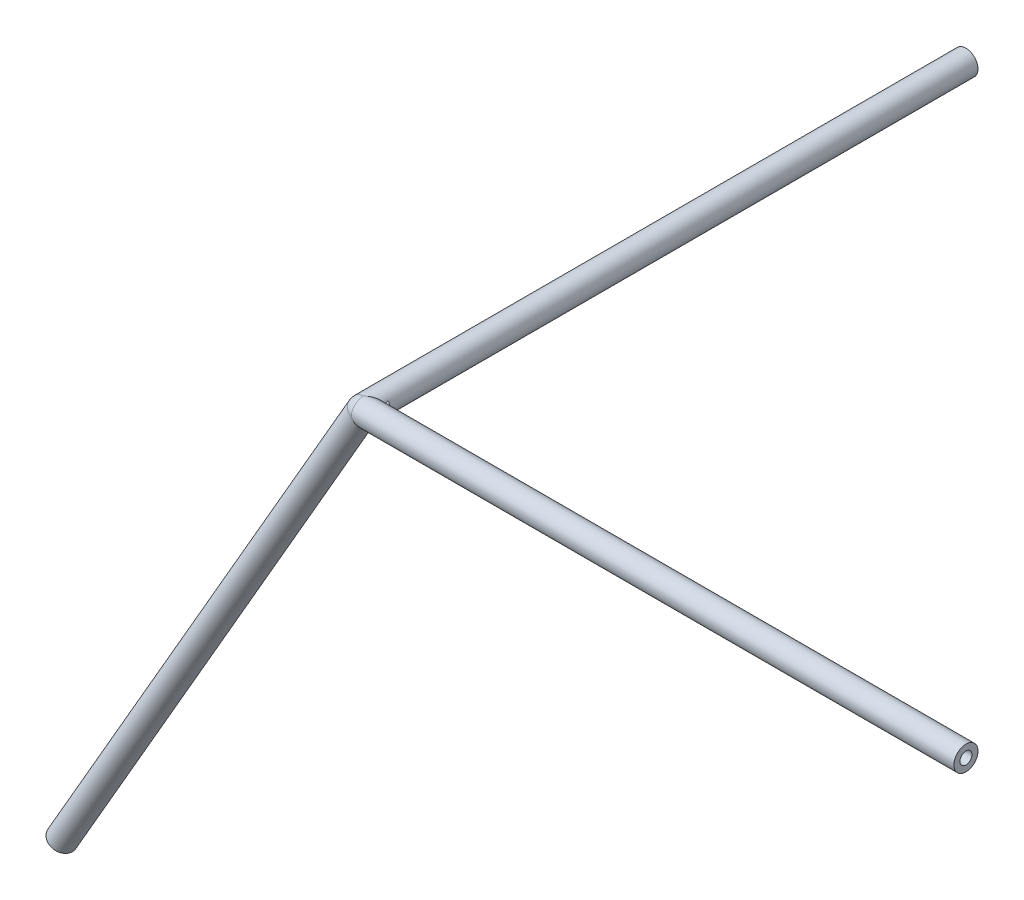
ISO-10303-21;
HEADER;
FILE_DESCRIPTION(('STEP AP214'),'2;1');
FILE_NAME('part.step','',(''),(''),'','','');
FILE_SCHEMA(('AUTOMOTIVE_DESIGN { 1 0 10303 214 1 1 1 1 }'));
ENDSEC;
DATA;
#1=APPLICATION_CONTEXT('core data for automotive mechanical design processes');
#2=APPLICATION_PROTOCOL_DEFINITION('international standard','automotive_design',2000,#1);
#3=PRODUCT_CONTEXT('',#1,'mechanical');
#4=PRODUCT('Part','Part','',(#3));
#5=PRODUCT_RELATED_PRODUCT_CATEGORY('part','',(#4));
#6=PRODUCT_DEFINITION_FORMATION('','',#4);
#7=PRODUCT_DEFINITION_CONTEXT('part definition',#1,'design');
#8=PRODUCT_DEFINITION('design','',#6,#7);
#9=PRODUCT_DEFINITION_SHAPE('','',#8);
#10=(LENGTH_UNIT() NAMED_UNIT(*) SI_UNIT(.MILLI.,.METRE.));
#11=(NAMED_UNIT(*) PLANE_ANGLE_UNIT() SI_UNIT($,.RADIAN.));
#12=(NAMED_UNIT(*) SI_UNIT($,.STERADIAN.) SOLID_ANGLE_UNIT());
#13=UNCERTAINTY_MEASURE_WITH_UNIT(LENGTH_MEASURE(1.E-05),#10,'distance_accuracy_value','');
#14=(GEOMETRIC_REPRESENTATION_CONTEXT(3) GLOBAL_UNCERTAINTY_ASSIGNED_CONTEXT((#13)) GLOBAL_UNIT_ASSIGNED_CONTEXT((#10,
#11,#12)) REPRESENTATION_CONTEXT('',''));
#15=CARTESIAN_POINT('',(0.,0.,0.));
#16=DIRECTION('',(0.,0.,1.));
#17=DIRECTION('',(1.,0.,0.));
#18=AXIS2_PLACEMENT_3D('',#15,#16,#17);
#19=CARTESIAN_POINT('',(0.,0.,0.));
#20=DIRECTION('',(1.,0.,0.));
#21=DIRECTION('',(0.,0.,-1.));
#22=AXIS2_PLACEMENT_3D('',#19,#20,#21);
#23=CYLINDRICAL_SURFACE('',#22,10.);
#24=CARTESIAN_POINT('',(12.2474487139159,-1.65082716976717,-9.86279725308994));
#25=CARTESIAN_POINT('',(12.1743298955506,-1.78822876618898,-9.83979079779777));
#26=CARTESIAN_POINT('',(12.093672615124,-1.92098861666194,-9.81462641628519));
#27=CARTESIAN_POINT('',(11.9198356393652,-2.17682382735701,-9.76107109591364));
#28=CARTESIAN_POINT('',(11.8266917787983,-2.29992535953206,-9.73268942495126));
#29=CARTESIAN_POINT('',(11.6310523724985,-2.53554719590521,-9.67396425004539));
#30=CARTESIAN_POINT('',(11.5286676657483,-2.64816670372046,-9.6436450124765));
#31=CARTESIAN_POINT('',(11.3153274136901,-2.86469305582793,-9.58155660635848));
#32=CARTESIAN_POINT('',(11.2043642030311,-2.96859193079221,-9.54978615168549));
#33=CARTESIAN_POINT('',(10.9326827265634,-3.20504967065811,-9.47355950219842));
#34=CARTESIAN_POINT('',(10.7688143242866,-3.3338873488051,-9.42878180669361));
#35=CARTESIAN_POINT('',(10.4303589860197,-3.5765937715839,-9.33941604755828));
#36=CARTESIAN_POINT('',(10.2557704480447,-3.69046027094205,-9.29482801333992));
#37=CARTESIAN_POINT('',(9.89660782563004,-3.90467747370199,-9.20689847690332));
#38=CARTESIAN_POINT('',(9.71197617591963,-4.00493544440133,-9.16356696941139));
#39=CARTESIAN_POINT('',(9.33522567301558,-4.19152815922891,-9.07973274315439));
#40=CARTESIAN_POINT('',(9.14310730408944,-4.27786380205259,-9.03922984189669));
#41=CARTESIAN_POINT('',(8.74610830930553,-4.43936254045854,-8.96104718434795));
#42=CARTESIAN_POINT('',(8.54101582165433,-4.51407048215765,-8.92350223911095));
#43=CARTESIAN_POINT('',(8.1250043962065,-4.64858449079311,-8.85417347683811));
#44=CARTESIAN_POINT('',(7.91408466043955,-4.70838850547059,-8.82239045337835));
#45=CARTESIAN_POINT('',(7.48815393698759,-4.81222273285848,-8.76618429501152));
#46=CARTESIAN_POINT('',(7.27315855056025,-4.85630379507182,-8.74173747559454));
#47=CARTESIAN_POINT('',(6.83961855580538,-4.92779842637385,-8.70163787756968));
#48=CARTESIAN_POINT('',(6.62107539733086,-4.95521863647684,-8.68598159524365));
#49=CARTESIAN_POINT('',(6.24481149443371,-4.98654859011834,-8.6680183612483));
#50=CARTESIAN_POINT('',(6.08757768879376,-4.99494021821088,-8.66317369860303));
#51=CARTESIAN_POINT('',(5.77283583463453,-5.00168659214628,-8.65928145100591));
#52=CARTESIAN_POINT('',(5.615327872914,-5.00004408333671,-8.66023228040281));
#53=CARTESIAN_POINT('',(5.30098545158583,-4.9859420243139,-8.66835916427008));
#54=CARTESIAN_POINT('',(5.14415079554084,-4.97348587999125,-8.67553325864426));
#55=CARTESIAN_POINT('',(4.83224702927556,-4.93696044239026,-8.69637088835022));
#56=CARTESIAN_POINT('',(4.67717793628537,-4.91289103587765,-8.71003448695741));
#57=CARTESIAN_POINT('',(4.3685629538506,-4.85209223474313,-8.74405104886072));
#58=CARTESIAN_POINT('',(4.21504975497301,-4.81523358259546,-8.76447220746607));
#59=CARTESIAN_POINT('',(3.91278019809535,-4.72833180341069,-8.81165818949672));
#60=CARTESIAN_POINT('',(3.76402384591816,-4.67828866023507,-8.83842302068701));
#61=CARTESIAN_POINT('',(3.47300572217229,-4.56474881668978,-8.8975928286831));
#62=CARTESIAN_POINT('',(3.33073977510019,-4.50126091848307,-8.9299941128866));
#63=CARTESIAN_POINT('',(3.05419473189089,-4.36084355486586,-8.99939807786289));
#64=CARTESIAN_POINT('',(2.91991447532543,-4.28391604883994,-9.03640008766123));
#65=CARTESIAN_POINT('',(2.67977184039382,-4.12926524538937,-9.10798099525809));
#66=CARTESIAN_POINT('',(2.57263057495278,-4.05331463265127,-9.14211890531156));
#67=CARTESIAN_POINT('',(2.36590118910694,-3.89232787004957,-9.21181160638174));
#68=CARTESIAN_POINT('',(2.26631279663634,-3.80729204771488,-9.24736634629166));
#69=CARTESIAN_POINT('',(2.07527042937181,-3.62868272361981,-9.31890089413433));
#70=CARTESIAN_POINT('',(1.98381707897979,-3.53510856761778,-9.35488073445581));
#71=CARTESIAN_POINT('',(1.80949324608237,-3.34008103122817,-9.42627386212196));
#72=CARTESIAN_POINT('',(1.72662293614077,-3.2386274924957,-9.46168713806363));
#73=CARTESIAN_POINT('',(1.57198424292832,-3.03151074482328,-9.5300314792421));
#74=CARTESIAN_POINT('',(1.4999704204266,-2.92604426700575,-9.56300424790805));
#75=CARTESIAN_POINT('',(1.36454847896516,-2.70903878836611,-9.62672839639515));
#76=CARTESIAN_POINT('',(1.30114318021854,-2.59749781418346,-9.65747904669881));
#77=CARTESIAN_POINT('',(1.18313303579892,-2.36916150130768,-9.71601561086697));
#78=CARTESIAN_POINT('',(1.12852523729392,-2.25236794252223,-9.74380251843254));
#79=CARTESIAN_POINT('',(1.02816589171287,-2.01421744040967,-9.79580467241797));
#80=CARTESIAN_POINT('',(0.98241767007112,-1.89285880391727,-9.82001857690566));
#81=CARTESIAN_POINT('',(0.898167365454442,-1.64131763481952,-9.86524553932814));
#82=CARTESIAN_POINT('',(0.860042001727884,-1.51097761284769,-9.88608537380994));
#83=CARTESIAN_POINT('',(0.793535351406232,-1.24710303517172,-9.92282653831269));
#84=CARTESIAN_POINT('',(0.765157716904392,-1.11356730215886,-9.93872601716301));
#85=CARTESIAN_POINT('',(0.718201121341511,-0.844273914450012,-9.96521474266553));
#86=CARTESIAN_POINT('',(0.699621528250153,-0.708516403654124,-9.97580433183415));
#87=CARTESIAN_POINT('',(0.672278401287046,-0.435696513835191,-9.99143826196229));
#88=CARTESIAN_POINT('',(0.663515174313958,-0.298634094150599,-9.99648242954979));
#89=CARTESIAN_POINT('',(0.655741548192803,-0.0215193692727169,-10.0009551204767));
#90=CARTESIAN_POINT('',(0.656920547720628,0.11854005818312,-10.000274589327));
#91=CARTESIAN_POINT('',(0.669482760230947,0.398050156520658,-9.99305266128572));
#92=CARTESIAN_POINT('',(0.68086611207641,0.53750081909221,-9.98651118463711));
#93=CARTESIAN_POINT('',(0.713825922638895,0.814815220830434,-9.967717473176));
#94=CARTESIAN_POINT('',(0.735403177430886,0.952678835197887,-9.95546479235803));
#95=CARTESIAN_POINT('',(0.788725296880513,1.22582356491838,-9.9255343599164));
#96=CARTESIAN_POINT('',(0.820469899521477,1.36110474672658,-9.90785674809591));
#97=CARTESIAN_POINT('',(0.894149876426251,1.62835067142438,-9.86746009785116));
#98=CARTESIAN_POINT('',(0.936102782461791,1.76030927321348,-9.84473239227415));
#99=CARTESIAN_POINT('',(1.03008993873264,2.01965778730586,-9.79481569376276));
#100=CARTESIAN_POINT('',(1.08212029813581,2.14704944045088,-9.76762842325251));
#101=CARTESIAN_POINT('',(1.19620110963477,2.39642850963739,-9.70945575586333));
#102=CARTESIAN_POINT('',(1.25825553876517,2.51841375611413,-9.67846885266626));
#103=CARTESIAN_POINT('',(1.39220085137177,2.75596141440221,-9.61352343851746));
#104=CARTESIAN_POINT('',(1.46408764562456,2.87152646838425,-9.57956616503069));
#105=CARTESIAN_POINT('',(1.61651415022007,3.09395787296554,-9.51003830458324));
#106=CARTESIAN_POINT('',(1.69693001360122,3.20091734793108,-9.47449424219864));
#107=CARTESIAN_POINT('',(1.86683104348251,3.40692785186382,-9.40238001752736));
#108=CARTESIAN_POINT('',(1.95631246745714,3.50598211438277,-9.36581028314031));
#109=CARTESIAN_POINT('',(2.14393354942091,3.69546995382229,-9.29267540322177));
#110=CARTESIAN_POINT('',(2.24207084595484,3.78590586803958,-9.25611025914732));
#111=CARTESIAN_POINT('',(2.4464664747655,3.95754797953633,-9.1840340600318));
#112=CARTESIAN_POINT('',(2.55272446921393,4.03875456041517,-9.14852296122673));
#113=CARTESIAN_POINT('',(2.76818438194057,4.18833794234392,-9.08098498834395));
#114=CARTESIAN_POINT('',(2.87709202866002,4.25710155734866,-9.04887521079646));
#115=CARTESIAN_POINT('',(3.10100135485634,4.38539609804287,-8.98740029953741));
#116=CARTESIAN_POINT('',(3.2160050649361,4.44492392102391,-8.95803608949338));
#117=CARTESIAN_POINT('',(3.45114919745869,4.55455291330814,-8.90279862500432));
#118=CARTESIAN_POINT('',(3.57128686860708,4.60465905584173,-8.87692353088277));
#119=CARTESIAN_POINT('',(3.8158335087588,4.69553429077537,-8.82918851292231));
#120=CARTESIAN_POINT('',(3.9402440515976,4.73629989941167,-8.80733008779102));
#121=CARTESIAN_POINT('',(4.31747110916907,4.84453358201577,-8.74856590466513));
#122=CARTESIAN_POINT('',(4.57533902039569,4.89842057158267,-8.71821921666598));
#123=CARTESIAN_POINT('',(5.09723598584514,4.97266371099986,-8.67608143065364));
#124=CARTESIAN_POINT('',(5.36126969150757,4.99299365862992,-8.66430483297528));
#125=CARTESIAN_POINT('',(5.82222135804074,5.00254979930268,-8.65877736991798));
#126=CARTESIAN_POINT('',(6.019019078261,4.99840565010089,-8.66118403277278));
#127=CARTESIAN_POINT('',(6.41150191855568,4.97515460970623,-8.67456215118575));
#128=CARTESIAN_POINT('',(6.60718651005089,4.95604112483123,-8.6855373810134));
#129=CARTESIAN_POINT('',(6.99645401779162,4.90405884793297,-8.71499216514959));
#130=CARTESIAN_POINT('',(7.19003269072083,4.87116620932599,-8.73348472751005));
#131=CARTESIAN_POINT('',(7.57380601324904,4.7926018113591,-8.77684330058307));
#132=CARTESIAN_POINT('',(7.76400104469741,4.74693150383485,-8.80170858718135));
#133=CARTESIAN_POINT('',(8.14531591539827,4.64209317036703,-8.85745951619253));
#134=CARTESIAN_POINT('',(8.33632402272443,4.58259631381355,-8.88848859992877));
#135=CARTESIAN_POINT('',(8.71325692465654,4.45123074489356,-8.95499672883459));
#136=CARTESIAN_POINT('',(8.8991812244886,4.37936083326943,-8.99047620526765));
#137=CARTESIAN_POINT('',(9.26516495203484,4.22332987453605,-9.06481976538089));
#138=CARTESIAN_POINT('',(9.4452227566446,4.13916546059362,-9.1036847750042));
#139=CARTESIAN_POINT('',(9.7984243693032,3.9583865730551,-9.18373305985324));
#140=CARTESIAN_POINT('',(9.97156949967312,3.86177449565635,-9.22491588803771));
#141=CARTESIAN_POINT('',(10.2775130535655,3.67527264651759,-9.30056308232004));
#142=CARTESIAN_POINT('',(10.4117189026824,3.58760264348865,-9.33481448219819));
#143=CARTESIAN_POINT('',(10.6739259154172,3.40344691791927,-9.40352125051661));
#144=CARTESIAN_POINT('',(10.8019267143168,3.30696067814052,-9.43797663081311));
#145=CARTESIAN_POINT('',(11.0500745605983,3.10518048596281,-9.50626908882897));
#146=CARTESIAN_POINT('',(11.170252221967,2.9999250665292,-9.54010815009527));
#147=CARTESIAN_POINT('',(11.4018415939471,2.77988031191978,-9.60653254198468));
#148=CARTESIAN_POINT('',(11.5132568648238,2.66509488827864,-9.63911837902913));
#149=CARTESIAN_POINT('',(11.7397544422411,2.40953454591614,-9.70638269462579));
#150=CARTESIAN_POINT('',(11.8533466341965,2.26733469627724,-9.74076130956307));
#151=CARTESIAN_POINT('',(12.0639858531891,1.96926017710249,-9.805370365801));
#152=CARTESIAN_POINT('',(12.1609464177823,1.81332006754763,-9.83557897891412));
#153=CARTESIAN_POINT('',(12.2474487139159,1.65082716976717,-9.86279725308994));
#154=B_SPLINE_CURVE_WITH_KNOTS('',3,(#24,#25,#26,#27,#28,#29,#30,#31,#32,#33,#34,#35,#36,#37,
#38,#39,#40,#41,#42,#43,#44,#45,#46,#47,#48,#49,#50,#51,#52,#53,#54,#55,#56,#57,#58,#59,#60,#61,
#62,#63,#64,#65,#66,#67,#68,#69,#70,#71,#72,#73,#74,#75,#76,#77,#78,#79,#80,#81,#82,#83,#84,#85,
#86,#87,#88,#89,#90,#91,#92,#93,#94,#95,#96,#97,#98,#99,#100,#101,#102,#103,#104,#105,#106,#107,
#108,#109,#110,#111,#112,#113,#114,#115,#116,#117,#118,#119,#120,#121,#122,#123,#124,#125,#126,
#127,#128,#129,#130,#131,#132,#133,#134,#135,#136,#137,#138,#139,#140,#141,#142,#143,#144,#145,
#146,#147,#148,#149,#150,#151,#152,#153),.UNSPECIFIED.,.F.,.F.,(4,2,2,2,2,2,2,2,2,2,2,2,2,2,2,2,
2,2,2,2,2,2,2,2,2,2,2,2,2,2,2,2,2,2,2,2,2,2,2,2,2,2,2,2,2,2,2,2,2,2,2,2,2,2,2,2,2,2,2,2,2,2,2,2,
4),(0.,0.471408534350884,0.941492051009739,1.40654103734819,1.87201048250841,2.51068011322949,
3.14944541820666,3.79236564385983,4.43524435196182,5.09904932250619,5.7629456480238,
6.42467497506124,7.08614036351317,7.55836284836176,8.03045613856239,8.50240079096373,
8.97435004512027,9.45121521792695,9.92808097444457,10.4046354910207,10.8811205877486,
11.2876972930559,11.6942593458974,12.1008525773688,12.5074539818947,12.9026984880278,
13.2980721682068,13.6933128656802,14.0887016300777,14.5003991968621,14.9122508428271,
15.3240759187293,15.7359138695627,16.1556147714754,16.5753213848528,16.9950607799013,
17.4147893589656,17.8352439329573,18.2555364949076,18.6759962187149,19.0962816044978,
19.5111348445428,19.9258175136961,20.3403873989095,20.7549400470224,21.1526763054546,
21.5505458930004,21.9482048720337,22.3460119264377,23.1381053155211,23.9308168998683,
24.5206157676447,25.1106745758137,25.7017588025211,26.292775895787,26.8996265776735,
27.506536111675,28.113612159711,28.7205715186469,29.2120203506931,29.7034980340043,
30.1929197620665,30.6821415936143,31.2365617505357,31.7937821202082),.UNSPECIFIED.);
#155=CARTESIAN_POINT('',(12.2474487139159,-1.65082716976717,-9.86279725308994));
#156=VERTEX_POINT('',#155);
#157=CARTESIAN_POINT('',(9.01388261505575,-4.33011780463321,-9.01388261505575));
#158=VERTEX_POINT('',#157);
#159=EDGE_CURVE('E224',#156,#158,#154,.T.);
#160=ORIENTED_EDGE('',*,*,#159,.F.);
#161=CARTESIAN_POINT('',(27.0416823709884,0.,0.));
#162=DIRECTION('',(0.554699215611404,0.,-0.832050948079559));
#163=DIRECTION('',(0.832050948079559,0.,0.554699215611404));
#164=AXIS2_PLACEMENT_3D('',#161,#162,#163);
#165=ELLIPSE('',#164,18.0277882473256,10.);
#166=CARTESIAN_POINT('',(12.2474487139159,1.65082716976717,-9.86279725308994));
#167=VERTEX_POINT('',#166);
#168=EDGE_CURVE('E226',#167,#156,#165,.F.);
#169=ORIENTED_EDGE('',*,*,#168,.F.);
#170=CARTESIAN_POINT('',(9.01388261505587,4.3301178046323,-9.01388261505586));
#171=VERTEX_POINT('',#170);
#172=EDGE_CURVE('E218',#171,#167,#154,.T.);
#173=ORIENTED_EDGE('',*,*,#172,.F.);
#174=CARTESIAN_POINT('',(0.,0.,0.));
#175=DIRECTION('',(0.707106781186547,0.,0.707106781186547));
#176=DIRECTION('',(0.707106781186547,0.,-0.707106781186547));
#177=AXIS2_PLACEMENT_3D('',#174,#175,#176);
#178=ELLIPSE('',#177,14.1421356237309,10.);
#179=CARTESIAN_POINT('',(0.,10.,0.));
#180=VERTEX_POINT('',#179);
#181=EDGE_CURVE('E247',#171,#180,#178,.T.);
#182=ORIENTED_EDGE('',*,*,#181,.T.);
#183=CARTESIAN_POINT('',(0.,0.,0.));
#184=DIRECTION('',(1.,0.,0.));
#185=DIRECTION('',(0.,0.,-1.));
#186=AXIS2_PLACEMENT_3D('',#183,#184,#185);
#187=CIRCLE('',#186,10.);
#188=CARTESIAN_POINT('',(0.,0.,10.));
#189=VERTEX_POINT('',#188);
#190=EDGE_CURVE('E251',#180,#189,#187,.T.);
#191=ORIENTED_EDGE('',*,*,#190,.T.);
#192=CARTESIAN_POINT('',(0.,0.,0.));
#193=DIRECTION('',(0.86602540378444,0.499999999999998,0.));
#194=DIRECTION('',(0.499999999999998,-0.86602540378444,0.));
#195=AXIS2_PLACEMENT_3D('',#192,#193,#194);
#196=ELLIPSE('',#195,11.5470053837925,10.);
#197=CARTESIAN_POINT('',(4.99999999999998,-8.66025403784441,-4.99999999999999));
#198=VERTEX_POINT('',#197);
#199=EDGE_CURVE('E261',#198,#189,#196,.F.);
#200=ORIENTED_EDGE('',*,*,#199,.F.);
#201=EDGE_CURVE('E244',#198,#158,#178,.T.);
#202=ORIENTED_EDGE('',*,*,#201,.T.);
#203=EDGE_LOOP('',(#160,#169,#173,#182,#191,#200,#202));
#204=FACE_BOUND('',#203,.T.);
#205=CARTESIAN_POINT('',(500.,0.,0.));
#206=DIRECTION('',(1.,0.,0.));
#207=DIRECTION('',(0.,0.,-1.));
#208=AXIS2_PLACEMENT_3D('',#205,#206,#207);
#209=CIRCLE('',#208,10.);
#210=CARTESIAN_POINT('',(500.,0.,-10.));
#211=VERTEX_POINT('',#210);
#212=EDGE_CURVE('E248',#211,#211,#209,.T.);
#213=ORIENTED_EDGE('',*,*,#212,.F.);
#214=EDGE_LOOP('',(#213));
#215=FACE_BOUND('',#214,.T.);
#216=ADVANCED_FACE('F38',(#204,#215),#23,.T.);
#217=CARTESIAN_POINT('',(500.,0.,0.));
#218=DIRECTION('',(1.,0.,0.));
#219=DIRECTION('',(0.,0.,-1.));
#220=AXIS2_PLACEMENT_3D('',#217,#218,#219);
#221=PLANE('',#220);
#222=CARTESIAN_POINT('',(500.,0.,0.));
#223=DIRECTION('',(1.,0.,0.));
#224=DIRECTION('',(0.,0.,-1.));
#225=AXIS2_PLACEMENT_3D('',#222,#223,#224);
#226=CIRCLE('',#225,5.);
#227=CARTESIAN_POINT('',(500.,0.,-5.));
#228=VERTEX_POINT('',#227);
#229=EDGE_CURVE('E126',#228,#228,#226,.T.);
#230=ORIENTED_EDGE('',*,*,#229,.F.);
#231=EDGE_LOOP('',(#230));
#232=FACE_BOUND('',#231,.T.);
#233=ORIENTED_EDGE('',*,*,#212,.T.);
#234=EDGE_LOOP('',(#233));
#235=FACE_BOUND('',#234,.T.);
#236=ADVANCED_FACE('F40',(#232,#235),#221,.T.);
#237=CARTESIAN_POINT('',(0.,0.,-500.));
#238=DIRECTION('',(0.,0.,1.));
#239=DIRECTION('',(1.,0.,0.));
#240=AXIS2_PLACEMENT_3D('',#237,#238,#239);
#241=PLANE('',#240);
#242=CARTESIAN_POINT('',(0.,0.,-500.));
#243=DIRECTION('',(0.,0.,1.));
#244=DIRECTION('',(1.,0.,0.));
#245=AXIS2_PLACEMENT_3D('',#242,#243,#244);
#246=CIRCLE('',#245,5.);
#247=CARTESIAN_POINT('',(5.,0.,-500.));
#248=VERTEX_POINT('',#247);
#249=EDGE_CURVE('E135',#248,#248,#246,.T.);
#250=ORIENTED_EDGE('',*,*,#249,.T.);
#251=EDGE_LOOP('',(#250));
#252=FACE_BOUND('',#251,.T.);
#253=CARTESIAN_POINT('',(0.,0.,-500.));
#254=DIRECTION('',(0.,0.,1.));
#255=DIRECTION('',(1.,0.,0.));
#256=AXIS2_PLACEMENT_3D('',#253,#254,#255);
#257=CIRCLE('',#256,10.);
#258=CARTESIAN_POINT('',(10.,0.,-500.));
#259=VERTEX_POINT('',#258);
#260=EDGE_CURVE('E255',#259,#259,#257,.T.);
#261=ORIENTED_EDGE('',*,*,#260,.F.);
#262=EDGE_LOOP('',(#261));
#263=FACE_BOUND('',#262,.T.);
#264=ADVANCED_FACE('F196',(#252,#263),#241,.F.);
#265=CARTESIAN_POINT('',(0.,0.,0.));
#266=DIRECTION('',(0.,0.,-1.));
#267=DIRECTION('',(-1.,0.,0.));
#268=AXIS2_PLACEMENT_3D('',#265,#266,#267);
#269=CYLINDRICAL_SURFACE('',#268,10.);
#270=CARTESIAN_POINT('',(0.,0.,-18.0277422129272));
#271=DIRECTION('',(-0.277349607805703,-0.480383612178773,-0.832050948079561));
#272=DIRECTION('',(0.416025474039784,0.720577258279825,-0.5546992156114));
#273=AXIS2_PLACEMENT_3D('',#270,#271,#272);
#274=ELLIPSE('',#273,12.0184948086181,10.);
#275=CARTESIAN_POINT('',(-0.0204529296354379,-9.99997908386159,-12.2474487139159));
#276=VERTEX_POINT('',#275);
#277=CARTESIAN_POINT('',(-8.6500094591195,-5.01770229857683,-12.2474487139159));
#278=VERTEX_POINT('',#277);
#279=EDGE_CURVE('E54',#276,#278,#274,.T.);
#280=ORIENTED_EDGE('',*,*,#279,.T.);
#281=CARTESIAN_POINT('',(-8.6500094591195,-5.01770229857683,-12.2474487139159));
#282=CARTESIAN_POINT('',(-8.64621153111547,-5.0242411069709,-12.1131979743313));
#283=CARTESIAN_POINT('',(-8.64132391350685,-5.03265778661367,-11.97905755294));
#284=CARTESIAN_POINT('',(-8.62914336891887,-5.0535188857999,-11.7111575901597));
#285=CARTESIAN_POINT('',(-8.62184965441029,-5.0659646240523,-11.5773981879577));
#286=CARTESIAN_POINT('',(-8.60459134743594,-5.09522282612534,-11.3098602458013));
#287=CARTESIAN_POINT('',(-8.59461394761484,-5.11205621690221,-11.1760847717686));
#288=CARTESIAN_POINT('',(-8.57172555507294,-5.15034058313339,-10.9094687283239));
#289=CARTESIAN_POINT('',(-8.55881483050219,-5.1717911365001,-10.7766280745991));
#290=CARTESIAN_POINT('',(-8.51478507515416,-5.24421165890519,-10.3760277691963));
#291=CARTESIAN_POINT('',(-8.47860172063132,-5.30284154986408,-10.1101204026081));
#292=CARTESIAN_POINT('',(-8.38969483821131,-5.44241652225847,-9.58746967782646));
#293=CARTESIAN_POINT('',(-8.33700749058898,-5.52331274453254,-9.33070762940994));
#294=CARTESIAN_POINT('',(-8.24019876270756,-5.66592413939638,-8.94627438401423));
#295=CARTESIAN_POINT('',(-8.20331916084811,-5.71929860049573,-8.81364220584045));
#296=CARTESIAN_POINT('',(-8.12294684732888,-5.83288899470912,-8.55336036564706));
#297=CARTESIAN_POINT('',(-8.07945385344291,-5.89310521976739,-8.42571091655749));
#298=CARTESIAN_POINT('',(-7.98544095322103,-6.01987740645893,-8.17708687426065));
#299=CARTESIAN_POINT('',(-7.93495433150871,-6.08640289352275,-8.05608424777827));
#300=CARTESIAN_POINT('',(-7.82623326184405,-6.22558174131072,-7.82127662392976));
#301=CARTESIAN_POINT('',(-7.76799899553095,-6.298234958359,-7.7074714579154));
#302=CARTESIAN_POINT('',(-7.6426610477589,-6.44976715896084,-7.48707349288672));
#303=CARTESIAN_POINT('',(-7.57547000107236,-6.52870390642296,-7.38056979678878));
#304=CARTESIAN_POINT('',(-7.43239230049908,-6.69113229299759,-7.17729021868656));
#305=CARTESIAN_POINT('',(-7.35650539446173,-6.77462406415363,-7.08051461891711));
#306=CARTESIAN_POINT('',(-7.19588046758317,-6.94499931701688,-6.89770847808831));
#307=CARTESIAN_POINT('',(-7.11113616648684,-7.0318851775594,-6.81168565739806));
#308=CARTESIAN_POINT('',(-6.93297845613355,-7.20759671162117,-6.65140420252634));
#309=CARTESIAN_POINT('',(-6.8395661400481,-7.29642213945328,-6.5771440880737));
#310=CARTESIAN_POINT('',(-6.65574714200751,-7.464226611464,-6.4490075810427));
#311=CARTESIAN_POINT('',(-6.56624304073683,-7.5431558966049,-6.39376689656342));
#312=CARTESIAN_POINT('',(-6.3811615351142,-7.70035796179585,-6.29346579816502));
#313=CARTESIAN_POINT('',(-6.28558456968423,-7.77863078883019,-6.2484046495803));
#314=CARTESIAN_POINT('',(-6.08893166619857,-7.93350935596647,-6.16877608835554));
#315=CARTESIAN_POINT('',(-5.98785772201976,-8.01011568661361,-6.13420490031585));
#316=CARTESIAN_POINT('',(-5.78083757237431,-8.16077826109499,-6.07574399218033));
#317=CARTESIAN_POINT('',(-5.67489154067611,-8.23483459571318,-6.05185389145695));
#318=CARTESIAN_POINT('',(-5.46645377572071,-8.37451537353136,-6.01618064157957));
#319=CARTESIAN_POINT('',(-5.36423853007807,-8.44036731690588,-6.0036677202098));
#320=CARTESIAN_POINT('',(-5.1569103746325,-8.56861342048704,-5.98804872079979));
#321=CARTESIAN_POINT('',(-5.05179653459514,-8.63100645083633,-5.9849456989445));
#322=CARTESIAN_POINT('',(-4.83951784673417,-8.75179826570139,-5.98816878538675));
#323=CARTESIAN_POINT('',(-4.73235416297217,-8.81019923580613,-5.99448969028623));
#324=CARTESIAN_POINT('',(-4.51668563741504,-8.92268724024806,-6.01652682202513));
#325=CARTESIAN_POINT('',(-4.40818031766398,-8.97677268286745,-6.03224649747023));
#326=CARTESIAN_POINT('',(-4.19205801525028,-9.07969161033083,-6.07276016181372));
#327=CARTESIAN_POINT('',(-4.08444649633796,-9.12858145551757,-6.09744029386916));
#328=CARTESIAN_POINT('',(-3.8695999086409,-9.22170861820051,-6.15578918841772));
#329=CARTESIAN_POINT('',(-3.76236498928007,-9.26594425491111,-6.189461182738));
#330=CARTESIAN_POINT('',(-3.54923052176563,-9.34965595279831,-6.26559656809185));
#331=CARTESIAN_POINT('',(-3.44333038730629,-9.38913417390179,-6.30805594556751));
#332=CARTESIAN_POINT('',(-3.23364450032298,-9.46339898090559,-6.40155126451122));
#333=CARTESIAN_POINT('',(-3.12985954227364,-9.49818383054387,-6.45259036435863));
#334=CARTESIAN_POINT('',(-2.92423704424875,-9.56350328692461,-6.56348566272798));
#335=CARTESIAN_POINT('',(-2.82243040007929,-9.59399063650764,-6.62342693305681));
#336=CARTESIAN_POINT('',(-2.62265717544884,-9.65051562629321,-6.75134660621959));
#337=CARTESIAN_POINT('',(-2.52469199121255,-9.67655165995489,-6.81932789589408));
#338=CARTESIAN_POINT('',(-2.33340906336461,-9.72444970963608,-6.96279729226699));
#339=CARTESIAN_POINT('',(-2.24008967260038,-9.7463132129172,-7.03828270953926));
#340=CARTESIAN_POINT('',(-2.05865539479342,-9.78624398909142,-7.19624484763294));
#341=CARTESIAN_POINT('',(-1.97054242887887,-9.80430986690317,-7.27872412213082));
#342=CARTESIAN_POINT('',(-1.79545449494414,-9.83792243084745,-7.45465910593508));
#343=CARTESIAN_POINT('',(-1.70879696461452,-9.85328079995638,-7.54846684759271));
#344=CARTESIAN_POINT('',(-1.54224684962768,-9.88071813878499,-7.7423770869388));
#345=CARTESIAN_POINT('',(-1.46235693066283,-9.89279582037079,-7.84248203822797));
#346=CARTESIAN_POINT('',(-1.23328217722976,-9.92486222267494,-8.15104656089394));
#347=CARTESIAN_POINT('',(-1.09458836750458,-9.94070297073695,-8.36786132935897));
#348=CARTESIAN_POINT('',(-0.874769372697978,-9.96212381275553,-8.76452975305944));
#349=CARTESIAN_POINT('',(-0.787768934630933,-9.96923809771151,-8.94114737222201));
#350=CARTESIAN_POINT('',(-0.629472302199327,-9.98048438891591,-9.30147738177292));
#351=CARTESIAN_POINT('',(-0.558184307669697,-9.98461484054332,-9.48519341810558));
#352=CARTESIAN_POINT('',(-0.430073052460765,-9.99095392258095,-9.85826938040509));
#353=CARTESIAN_POINT('',(-0.373299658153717,-9.9931559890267,-10.04764633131));
#354=CARTESIAN_POINT('',(-0.273239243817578,-9.99639096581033,-10.4298474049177));
#355=CARTESIAN_POINT('',(-0.229949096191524,-9.99742414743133,-10.6226707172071));
#356=CARTESIAN_POINT('',(-0.147267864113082,-9.99902013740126,-11.053683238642));
#357=CARTESIAN_POINT('',(-0.11087190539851,-9.99942776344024,-11.2924474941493));
#358=CARTESIAN_POINT('',(-0.0683540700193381,-9.99977531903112,-11.6509631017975));
#359=CARTESIAN_POINT('',(-0.0562190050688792,-9.99984742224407,-11.7700509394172));
#360=CARTESIAN_POINT('',(-0.0356332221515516,-9.99994165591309,-12.0085411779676));
#361=CARTESIAN_POINT('',(-0.0271823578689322,-9.99996378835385,-12.1279435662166));
#362=CARTESIAN_POINT('',(-0.0204529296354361,-9.99997908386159,-12.2474487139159));
#363=B_SPLINE_CURVE_WITH_KNOTS('',3,(#281,#282,#283,#284,#285,#286,#287,#288,#289,#290,#291,
#292,#293,#294,#295,#296,#297,#298,#299,#300,#301,#302,#303,#304,#305,#306,#307,#308,#309,#310,
#311,#312,#313,#314,#315,#316,#317,#318,#319,#320,#321,#322,#323,#324,#325,#326,#327,#328,#329,
#330,#331,#332,#333,#334,#335,#336,#337,#338,#339,#340,#341,#342,#343,#344,#345,#346,#347,#348,
#349,#350,#351,#352,#353,#354,#355,#356,#357,#358,#359,#360,#361,#362),.UNSPECIFIED.,.F.,.F.,(4,
2,2,2,2,2,2,2,2,2,2,2,2,2,2,2,2,2,2,2,2,2,2,2,2,2,2,2,2,2,2,2,2,2,2,2,2,2,2,2,4),(0.,
0.403389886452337,0.806911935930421,1.21239497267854,1.61784095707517,2.44056932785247,
3.26150657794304,3.70412470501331,4.14676172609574,4.58736020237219,5.02794835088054,
5.47320053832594,5.91846563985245,6.36404862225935,6.80957548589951,7.20355801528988,
7.59751210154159,7.99132423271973,8.38512232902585,8.75138389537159,9.11776440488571,
9.48394269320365,9.85025542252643,10.2120677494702,10.5740102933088,10.9357878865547,
11.2976989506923,11.663322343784,12.0290774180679,12.3947018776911,12.7604604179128,
13.1459372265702,13.5315651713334,14.3023774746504,14.8926641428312,15.4832581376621,
16.0758547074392,16.6683137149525,17.3921966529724,17.7512659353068,18.1103209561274),.UNSPECIFIED.);
#364=CARTESIAN_POINT('',(-8.25693332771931,-5.64119242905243,-9.01388261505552));
#365=VERTEX_POINT('',#364);
#366=EDGE_CURVE('E162',#278,#365,#363,.T.);
#367=ORIENTED_EDGE('',*,*,#366,.T.);
#368=CARTESIAN_POINT('',(0.,0.,0.));
#369=DIRECTION('',(0.353553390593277,0.612372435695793,-0.707106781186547));
#370=DIRECTION('',(-0.353553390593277,-0.612372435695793,-0.707106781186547));
#371=AXIS2_PLACEMENT_3D('',#368,#369,#370);
#372=ELLIPSE('',#371,14.142135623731,10.);
#373=CARTESIAN_POINT('',(-8.66025403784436,5.00000000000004,0.));
#374=VERTEX_POINT('',#373);
#375=EDGE_CURVE('E243',#365,#374,#372,.T.);
#376=ORIENTED_EDGE('',*,*,#375,.T.);
#377=CARTESIAN_POINT('',(0.,0.,0.));
#378=DIRECTION('',(0.,0.,1.));
#379=DIRECTION('',(1.,0.,0.));
#380=AXIS2_PLACEMENT_3D('',#377,#378,#379);
#381=CIRCLE('',#380,10.);
#382=EDGE_CURVE('E258',#180,#374,#381,.T.);
#383=ORIENTED_EDGE('',*,*,#382,.F.);
#384=ORIENTED_EDGE('',*,*,#181,.F.);
#385=CARTESIAN_POINT('',(8.67046238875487,-4.98227678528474,-12.2474487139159));
#386=CARTESIAN_POINT('',(8.6742261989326,-4.97571827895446,-12.1131979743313));
#387=CARTESIAN_POINT('',(8.67907144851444,-4.96727713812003,-11.97905755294));
#388=CARTESIAN_POINT('',(8.6910474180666,-4.9462979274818,-11.7111575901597));
#389=CARTESIAN_POINT('',(8.69817888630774,-4.93375851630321,-11.5773981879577));
#390=CARTESIAN_POINT('',(8.71488807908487,-4.9041832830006,-11.3098602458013));
#391=CARTESIAN_POINT('',(8.72447752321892,-4.88712590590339,-11.1760847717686));
#392=CARTESIAN_POINT('',(8.74618856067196,-4.84816179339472,-10.9094687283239));
#393=CARTESIAN_POINT('',(8.75830992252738,-4.82625550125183,-10.7766280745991));
#394=CARTESIAN_POINT('',(8.79901305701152,-4.75191435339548,-10.3760277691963));
#395=CARTESIAN_POINT('',(8.83169635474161,-4.69126370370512,-10.1101204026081));
#396=CARTESIAN_POINT('',(8.90811838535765,-4.54448059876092,-9.58746967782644));
#397=CARTESIAN_POINT('',(8.95183289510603,-4.45840390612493,-9.33070762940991));
#398=CARTESIAN_POINT('',(9.02693362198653,-4.30325939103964,-8.94627438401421));
#399=CARTESIAN_POINT('',(9.05471746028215,-4.24463348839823,-8.81364220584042));
#400=CARTESIAN_POINT('',(9.11290347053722,-4.11823382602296,-8.55336036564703));
#401=CARTESIAN_POINT('',(9.14330575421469,-4.05045967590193,-8.42571091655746));
#402=CARTESIAN_POINT('',(9.20608723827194,-3.90565602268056,-8.17708687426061));
#403=CARTESIAN_POINT('',(9.23845668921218,-3.82867058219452,-8.05608424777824));
#404=CARTESIAN_POINT('',(9.30462857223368,-3.66492595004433,-7.82127662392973));
#405=CARTESIAN_POINT('',(9.3384309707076,-3.57816698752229,-7.70747145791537));
#406=CARTESIAN_POINT('',(9.40699273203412,-3.39385504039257,-7.48707349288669));
#407=CARTESIAN_POINT('',(9.44175843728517,-3.2961975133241,-7.38056979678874));
#408=CARTESIAN_POINT('',(9.51088669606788,-3.09107439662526,-7.17729021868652));
#409=CARTESIAN_POINT('',(9.54524923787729,-2.9836085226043,-7.08051461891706));
#410=CARTESIAN_POINT('',(9.61248607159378,-2.75931562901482,-6.89770847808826));
#411=CARTESIAN_POINT('',(9.64535928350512,-2.64248198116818,-6.81168565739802));
#412=CARTESIAN_POINT('',(9.7084510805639,-2.40033711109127,-6.6514042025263));
#413=CARTESIAN_POINT('',(9.73866999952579,-2.27502695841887,-6.57714408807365));
#414=CARTESIAN_POINT('',(9.79208343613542,-2.03193280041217,-6.44900758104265));
#415=CARTESIAN_POINT('',(9.81568615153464,-1.91495533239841,-6.39376689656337));
#416=CARTESIAN_POINT('',(9.85928638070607,-1.67606901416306,-6.29346579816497));
#417=CARTESIAN_POINT('',(9.87928415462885,-1.55416052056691,-6.24840464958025));
#418=CARTESIAN_POINT('',(9.91508647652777,-1.30641482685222,-6.16877608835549));
#419=CARTESIAN_POINT('',(9.9308925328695,-1.18057905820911,-6.1342049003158));
#420=CARTESIAN_POINT('',(9.95786007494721,-0.925963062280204,-6.07574399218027));
#421=CARTESIAN_POINT('',(9.96902172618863,-0.797182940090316,-6.05185389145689));
#422=CARTESIAN_POINT('',(9.98576994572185,-0.546830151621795,-6.01618064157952));
#423=CARTESIAN_POINT('',(9.99169177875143,-0.425383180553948,-6.00366772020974));
#424=CARTESIAN_POINT('',(9.9990920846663,-0.181708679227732,-5.98804872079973));
#425=CARTESIAN_POINT('',(10.0005691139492,-0.059480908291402,-5.98494569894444));
#426=CARTESIAN_POINT('',(9.99903855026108,0.184753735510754,-5.98816878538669));
#427=CARTESIAN_POINT('',(9.99603343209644,0.306760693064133,-5.99448969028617));
#428=CARTESIAN_POINT('',(9.98561663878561,0.549779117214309,-6.01652682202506));
#429=CARTESIAN_POINT('',(9.97820334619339,0.670790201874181,-6.03224649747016));
#430=CARTESIAN_POINT('',(9.95927260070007,0.90941706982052,-6.07276016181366));
#431=CARTESIAN_POINT('',(9.94780668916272,1.02705630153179,-6.0974402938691));
#432=CARTESIAN_POINT('',(9.92103388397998,1.25968248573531,-6.15578918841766));
#433=CARTESIAN_POINT('',(9.90572560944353,1.37466846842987,-6.18946118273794));
#434=CARTESIAN_POINT('',(9.87165483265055,1.60110418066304,-6.26559656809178));
#435=CARTESIAN_POINT('',(9.85289390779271,1.71255549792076,-6.30805594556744));
#436=CARTESIAN_POINT('',(9.81236617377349,1.93128120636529,-6.40155126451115));
#437=CARTESIAN_POINT('',(9.79059825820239,2.03855404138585,-6.45259036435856));
#438=CARTESIAN_POINT('',(9.74435531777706,2.24928807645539,-6.56348566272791));
#439=CARTESIAN_POINT('',(9.71985481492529,2.3526988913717,-6.62342693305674));
#440=CARTESIAN_POINT('',(9.66892027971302,2.5539700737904,-6.75134660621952));
#441=CARTESIAN_POINT('',(9.64248555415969,2.65182842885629,-6.81932789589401));
#442=CARTESIAN_POINT('',(9.58832501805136,2.84143332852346,-6.96279729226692));
#443=CARTESIAN_POINT('',(9.56059967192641,2.93318204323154,-7.03828270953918));
#444=CARTESIAN_POINT('',(9.50446359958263,3.11027412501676,-7.19624484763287));
#445=CARTESIAN_POINT('',(9.476052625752,3.19561513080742,-7.27872412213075));
#446=CARTESIAN_POINT('',(9.4176179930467,3.36405201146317,-7.45465910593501));
#447=CARTESIAN_POINT('',(9.38758996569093,3.4467788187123,-7.54846684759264));
#448=CARTESIAN_POINT('',(9.32807634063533,3.60473411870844,-7.74237708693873));
#449=CARTESIAN_POINT('',(9.29859096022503,3.67995965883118,-7.84248203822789));
#450=CARTESIAN_POINT('',(9.21182390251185,3.89437741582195,-8.15104656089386));
#451=CARTESIAN_POINT('',(9.15619548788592,4.02241015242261,-8.36786132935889));
#452=CARTESIAN_POINT('',(9.06483698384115,4.22348940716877,-8.76452975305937));
#453=CARTESIAN_POINT('',(9.02749791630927,4.3023911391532,-8.94114737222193));
#454=CARTESIAN_POINT('',(8.95808917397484,4.4451031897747,-9.30147738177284));
#455=CARTESIAN_POINT('',(8.92602225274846,4.5089056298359,-9.4851934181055));
#456=CARTESIAN_POINT('',(8.86745643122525,4.62302277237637,-9.85826938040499));
#457=CARTESIAN_POINT('',(8.84097677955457,4.67329100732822,-10.04764633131));
#458=CARTESIAN_POINT('',(8.79374814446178,4.76156335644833,-10.4298474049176));
#459=CARTESIAN_POINT('',(8.77299783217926,4.79957031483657,-10.622670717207));
#460=CARTESIAN_POINT('',(8.73303938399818,4.87197235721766,-11.0536832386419));
#461=CARTESIAN_POINT('',(8.71519441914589,4.90369599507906,-11.2924474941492));
#462=CARTESIAN_POINT('',(8.69423649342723,4.94069129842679,-11.6509631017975));
#463=CARTESIAN_POINT('',(8.68823140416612,4.95123662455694,-11.7700509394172));
#464=CARTESIAN_POINT('',(8.67802012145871,4.96911155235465,-12.0085411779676));
#465=CARTESIAN_POINT('',(8.67381385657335,4.97644128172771,-12.1279435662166));
#466=CARTESIAN_POINT('',(8.67046238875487,4.98227678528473,-12.2474487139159));
#467=B_SPLINE_CURVE_WITH_KNOTS('',3,(#385,#386,#387,#388,#389,#390,#391,#392,#393,#394,#395,
#396,#397,#398,#399,#400,#401,#402,#403,#404,#405,#406,#407,#408,#409,#410,#411,#412,#413,#414,
#415,#416,#417,#418,#419,#420,#421,#422,#423,#424,#425,#426,#427,#428,#429,#430,#431,#432,#433,
#434,#435,#436,#437,#438,#439,#440,#441,#442,#443,#444,#445,#446,#447,#448,#449,#450,#451,#452,
#453,#454,#455,#456,#457,#458,#459,#460,#461,#462,#463,#464,#465,#466),.UNSPECIFIED.,.F.,.F.,(4,
2,2,2,2,2,2,2,2,2,2,2,2,2,2,2,2,2,2,2,2,2,2,2,2,2,2,2,2,2,2,2,2,2,2,2,2,2,2,2,4),(0.,
0.403389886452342,0.806911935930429,1.21239497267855,1.61784095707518,2.44056932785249,
3.26150657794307,3.70412470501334,4.14676172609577,4.58736020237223,5.02794835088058,
5.47320053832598,5.91846563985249,6.36404862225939,6.80957548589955,7.20355801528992,
7.59751210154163,7.99132423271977,8.3851223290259,8.75138389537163,9.11776440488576,
9.4839426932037,9.85025542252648,10.2120677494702,10.5740102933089,10.9357878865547,
11.2976989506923,11.6633223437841,12.029077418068,12.3947018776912,12.7604604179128,
13.1459372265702,13.5315651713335,14.3023774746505,14.8926641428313,15.4832581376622,
16.0758547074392,16.6683137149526,17.3921966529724,17.7512659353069,18.1103209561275),.UNSPECIFIED.);
#468=CARTESIAN_POINT('',(8.67046238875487,4.98227678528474,-12.2474487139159));
#469=VERTEX_POINT('',#468);
#470=EDGE_CURVE('E234',#171,#469,#467,.T.);
#471=ORIENTED_EDGE('',*,*,#470,.T.);
#472=CARTESIAN_POINT('',(0.,0.,-18.0277422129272));
#473=DIRECTION('',(0.554699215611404,0.,-0.832050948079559));
#474=DIRECTION('',(-0.832050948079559,0.,-0.554699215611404));
#475=AXIS2_PLACEMENT_3D('',#472,#473,#474);
#476=ELLIPSE('',#475,12.0184948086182,10.);
#477=CARTESIAN_POINT('',(8.67046238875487,-4.98227678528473,-12.2474487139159));
#478=VERTEX_POINT('',#477);
#479=EDGE_CURVE('E187',#469,#478,#476,.T.);
#480=ORIENTED_EDGE('',*,*,#479,.T.);
#481=EDGE_CURVE('E186',#478,#158,#467,.T.);
#482=ORIENTED_EDGE('',*,*,#481,.T.);
#483=ORIENTED_EDGE('',*,*,#201,.F.);
#484=CARTESIAN_POINT('',(-0.756949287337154,-9.97131023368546,-9.01388261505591));
#485=VERTEX_POINT('',#484);
#486=EDGE_CURVE('E241',#198,#485,#372,.T.);
#487=ORIENTED_EDGE('',*,*,#486,.T.);
#488=EDGE_CURVE('E59',#485,#276,#363,.T.);
#489=ORIENTED_EDGE('',*,*,#488,.T.);
#490=EDGE_LOOP('',(#280,#367,#376,#383,#384,#471,#480,#482,#483,#487,#489));
#491=FACE_BOUND('',#490,.T.);
#492=ORIENTED_EDGE('',*,*,#260,.T.);
#493=EDGE_LOOP('',(#492));
#494=FACE_BOUND('',#493,.T.);
#495=ADVANCED_FACE('F164',(#491,#494),#269,.T.);
#496=CARTESIAN_POINT('',(-250.000000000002,-433.012701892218,0.));
#497=DIRECTION('',(-0.500000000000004,-0.866025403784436,0.));
#498=DIRECTION('',(0.866025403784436,-0.500000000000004,0.));
#499=AXIS2_PLACEMENT_3D('',#496,#497,#498);
#500=PLANE('',#499);
#501=CARTESIAN_POINT('',(-250.000000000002,-433.012701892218,0.));
#502=DIRECTION('',(-0.500000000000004,-0.866025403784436,0.));
#503=DIRECTION('',(0.866025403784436,-0.500000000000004,0.));
#504=AXIS2_PLACEMENT_3D('',#501,#502,#503);
#505=CIRCLE('',#504,5.00000000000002);
#506=CARTESIAN_POINT('',(-245.66987298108,-435.512701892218,0.));
#507=VERTEX_POINT('',#506);
#508=EDGE_CURVE('E142',#507,#507,#505,.T.);
#509=ORIENTED_EDGE('',*,*,#508,.F.);
#510=EDGE_LOOP('',(#509));
#511=FACE_BOUND('',#510,.T.);
#512=CARTESIAN_POINT('',(-250.000000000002,-433.012701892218,0.));
#513=DIRECTION('',(-0.500000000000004,-0.866025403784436,0.));
#514=DIRECTION('',(0.866025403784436,-0.500000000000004,0.));
#515=AXIS2_PLACEMENT_3D('',#512,#513,#514);
#516=CIRCLE('',#515,10.);
#517=CARTESIAN_POINT('',(-241.339745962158,-438.012701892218,0.));
#518=VERTEX_POINT('',#517);
#519=EDGE_CURVE('E264',#518,#518,#516,.T.);
#520=ORIENTED_EDGE('',*,*,#519,.T.);
#521=EDGE_LOOP('',(#520));
#522=FACE_BOUND('',#521,.T.);
#523=ADVANCED_FACE('F194',(#511,#522),#500,.T.);
#524=CARTESIAN_POINT('',(0.,0.,0.));
#525=DIRECTION('',(-0.500000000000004,-0.866025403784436,0.));
#526=DIRECTION('',(0.866025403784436,-0.500000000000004,0.));
#527=AXIS2_PLACEMENT_3D('',#524,#525,#526);
#528=CYLINDRICAL_SURFACE('',#527,10.);
#529=CARTESIAN_POINT('',(-7.55338262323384,-9.78118813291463,-9.86279725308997));
#530=CARTESIAN_POINT('',(-7.63581648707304,-9.64916458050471,-9.8397907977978));
#531=CARTESIAN_POINT('',(-7.71046124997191,-9.51293340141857,-9.81462641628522));
#532=CARTESIAN_POINT('',(-7.84510255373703,-9.23446855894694,-9.76107109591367));
#533=CARTESIAN_POINT('',(-7.90513967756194,-9.09225284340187,-9.73268942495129));
#534=CARTESIAN_POINT('',(-8.01137447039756,-8.80501322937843,-9.67396425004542));
#535=CARTESIAN_POINT('',(-8.05771347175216,-8.6600357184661,-9.64364501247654));
#536=CARTESIAN_POINT('',(-8.1385606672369,-8.36701446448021,-9.58155660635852));
#537=CARTESIAN_POINT('',(-8.17305812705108,-8.21896806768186,-9.54978615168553));
#538=CARTESIAN_POINT('',(-8.24199579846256,-7.86545613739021,-9.47355950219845));
#539=CARTESIAN_POINT('',(-8.27163829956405,-7.65912309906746,-9.42878180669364));
#540=CARTESIAN_POINT('',(-8.31260055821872,-7.24465896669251,-9.33941604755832));
#541=CARTESIAN_POINT('',(-8.32391757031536,-7.03652760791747,-9.29482801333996));
#542=CARTESIAN_POINT('',(-8.32985379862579,-6.61837505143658,-9.20689847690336));
#543=CARTESIAN_POINT('',(-8.32436392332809,-6.40835036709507,-9.16356696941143));
#544=CARTESIAN_POINT('',(-8.29758270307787,-5.98877850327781,-9.07973274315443));
#545=CARTESIAN_POINT('',(-8.27629237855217,-5.77923129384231,-9.03922984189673));
#546=CARTESIAN_POINT('',(-8.21765489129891,-5.35467070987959,-8.96104718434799));
#547=CARTESIAN_POINT('',(-8.17980762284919,-5.13970143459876,-8.92350223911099));
#548=CARTESIAN_POINT('',(-8.08829445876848,-4.71216796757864,-8.85417347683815));
#549=CARTESIAN_POINT('',(-8.034626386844,-4.49960411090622,-8.82239045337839));
#550=CARTESIAN_POINT('',(-7.91158410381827,-4.07882017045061,-8.76618429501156));
#551=CARTESIAN_POINT('',(-7.84226173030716,-3.8705881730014,-8.74173747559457));
#552=CARTESIAN_POINT('',(-7.6874078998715,-3.45938420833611,-8.7016378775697));
#553=CARTESIAN_POINT('',(-7.60188291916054,-3.2564101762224,-8.68598159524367));
#554=CARTESIAN_POINT('',(-7.4408835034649,-2.91489110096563,-8.66801836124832));
#555=CARTESIAN_POINT('',(-7.36953396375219,-2.77452681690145,-8.66317369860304));
#556=CARTESIAN_POINT('',(-7.21800556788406,-2.49857918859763,-8.65928145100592));
#557=CARTESIAN_POINT('',(-7.13782913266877,-2.36299454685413,-8.66023228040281));
#558=CARTESIAN_POINT('',(-6.96844518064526,-2.09781705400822,-8.66835916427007));
#559=CARTESIAN_POINT('',(-6.87924051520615,-1.96822232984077,-8.67553325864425));
#560=CARTESIAN_POINT('',(-6.69165667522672,-1.71636846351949,-8.6963708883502));
#561=CARTESIAN_POINT('',(-6.59327741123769,-1.59410939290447,-8.7100344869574));
#562=CARTESIAN_POINT('',(-6.38631661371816,-1.35724037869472,-8.74405104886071));
#563=CARTESIAN_POINT('',(-6.27763948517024,-1.24272337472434,-8.76447220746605));
#564=CARTESIAN_POINT('',(-6.05124555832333,-1.02440114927,-8.8116581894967));
#565=CARTESIAN_POINT('',(-5.93352874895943,-0.920595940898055,-8.83842302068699));
#566=CARTESIAN_POINT('',(-5.68969129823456,-0.725336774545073,-8.89759282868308));
#567=CARTESIAN_POINT('',(-5.56357619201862,-0.633874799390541,-8.92999411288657));
#568=CARTESIAN_POINT('',(-5.30369866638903,-0.464588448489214,-8.99939807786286));
#569=CARTESIAN_POINT('',(-5.16993736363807,-0.38676208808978,-9.0364000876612));
#570=CARTESIAN_POINT('',(-4.9159345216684,-0.256117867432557,-9.10798099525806));
#571=CARTESIAN_POINT('',(-4.79658872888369,-0.201306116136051,-9.14211890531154));
#572=CARTESIAN_POINT('',(-4.55380540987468,-0.102766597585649,-9.21181160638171));
#573=CARTESIAN_POINT('',(-4.43036803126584,-0.0590384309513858,-9.24736634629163));
#574=CARTESIAN_POINT('',(-4.18016663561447,0.0171044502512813,-9.3189008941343));
#575=CARTESIAN_POINT('',(-4.05340236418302,0.0495182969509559,-9.35488073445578));
#576=CARTESIAN_POINT('',(-3.79734164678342,0.102973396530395,-9.42627386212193));
#577=CARTESIAN_POINT('',(-3.66804514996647,0.124014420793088,-9.46168713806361));
#578=CARTESIAN_POINT('',(-3.41135743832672,0.15437708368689,-9.53003147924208));
#579=CARTESIAN_POINT('',(-3.28401387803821,0.16400964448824,-9.56300424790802));
#580=CARTESIAN_POINT('',(-3.02837065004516,0.172785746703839,-9.62672839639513));
#581=CARTESIAN_POINT('',(-2.90007068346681,0.171925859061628,-9.65747904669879));
#582=CARTESIAN_POINT('',(-2.6433205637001,0.159957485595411,-9.71601561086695));
#583=CARTESIAN_POINT('',(-2.51487047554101,0.148852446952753,-9.74380251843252));
#584=CARTESIAN_POINT('',(-2.25844641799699,0.116690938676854,-9.79580467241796));
#585=CARTESIAN_POINT('',(-2.13047264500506,0.0956307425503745,-9.82001857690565));
#586=CARTESIAN_POINT('',(-1.87050645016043,0.0428230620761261,-9.86524553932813));
#587=CARTESIAN_POINT('',(-1.73856599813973,0.010670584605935,-9.88608537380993));
#588=CARTESIAN_POINT('',(-1.47679058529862,-0.0636702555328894,-9.92282653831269));
#589=CARTESIAN_POINT('',(-1.34695643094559,-0.105862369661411,-9.93872601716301));
#590=CARTESIAN_POINT('',(-1.09026321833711,-0.199843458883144,-9.96521474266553));
#591=CARTESIAN_POINT('',(-0.963403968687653,-0.251631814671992,-9.97580433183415));
#592=CARTESIAN_POINT('',(-0.71346344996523,-0.364361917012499,-9.9914382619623));
#593=CARTESIAN_POINT('',(-0.590382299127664,-0.425303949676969,-9.9964824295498));
#594=CARTESIAN_POINT('',(-0.346507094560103,-0.557129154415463,-10.0009551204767));
#595=CARTESIAN_POINT('',(-0.225801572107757,-0.628179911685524,-10.000274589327));
#596=CARTESIAN_POINT('',(0.00998016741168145,-0.778814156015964,-9.99305266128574));
#597=CARTESIAN_POINT('',(0.125056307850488,-0.858397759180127,-9.98651118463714));
#598=CARTESIAN_POINT('',(0.348737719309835,-1.02559899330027,-9.96771747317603));
#599=CARTESIAN_POINT('',(0.457342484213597,-1.11321725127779,-9.95546479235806));
#600=CARTESIAN_POINT('',(0.667231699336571,-1.29596792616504,-9.92553435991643));
#601=CARTESIAN_POINT('',(0.768516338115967,-1.39110014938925,-9.90785674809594));
#602=CARTESIAN_POINT('',(0.963118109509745,-1.58853184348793,-9.8674600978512));
#603=CARTESIAN_POINT('',(1.05642115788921,-1.69084342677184,-9.84473239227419));
#604=CARTESIAN_POINT('',(1.23402998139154,-1.90191294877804,-9.7948156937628));
#605=CARTESIAN_POINT('',(1.31833920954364,-2.01066838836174,-9.76762842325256));
#606=CARTESIAN_POINT('',(1.4772674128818,-2.23415480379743,-9.70945575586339));
#607=CARTESIAN_POINT('',(1.55188252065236,-2.34888813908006,-9.67846885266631));
#608=CARTESIAN_POINT('',(1.69063217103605,-2.58366201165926,-9.61352343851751));
#609=CARTESIAN_POINT('',(1.75477104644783,-2.70370032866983,-9.57956616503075));
#610=CARTESIAN_POINT('',(1.87118904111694,-2.94692125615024,-9.5100383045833));
#611=CARTESIAN_POINT('',(1.92361073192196,-3.07004317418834,-9.4744942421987));
#612=CARTESIAN_POINT('',(2.01707054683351,-3.32018703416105,-9.40238001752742));
#613=CARTESIAN_POINT('',(2.05811334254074,-3.44720735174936,-9.36581028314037));
#614=CARTESIAN_POINT('',(2.12840408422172,-3.70443589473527,-9.29267540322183));
#615=CARTESIAN_POINT('',(2.1576552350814,-3.83464324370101,-9.25611025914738));
#616=CARTESIAN_POINT('',(2.20410384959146,-4.09747610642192,-9.18403406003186));
#617=CARTESIAN_POINT('',(2.2213018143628,-4.23010151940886,-9.14852296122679));
#618=CARTESIAN_POINT('',(2.24311486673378,-4.49148696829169,-9.08098498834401));
#619=CARTESIAN_POINT('',(2.24821208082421,-4.62018556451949,-9.04887521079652));
#620=CARTESIAN_POINT('',(2.2473637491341,-4.87824399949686,-8.98740029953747));
#621=CARTESIAN_POINT('',(2.24141450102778,-5.00760404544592,-8.95803608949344));
#622=CARTESIAN_POINT('',(2.21878392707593,-5.26605933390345,-8.90279862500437));
#623=CARTESIAN_POINT('',(2.20210828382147,-5.39515468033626,-8.87692353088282));
#624=CARTESIAN_POINT('',(2.15853522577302,-5.6523759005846,-8.82918851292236));
#625=CARTESIAN_POINT('',(2.1316340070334,-5.78050139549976,-8.80733008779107));
#626=CARTESIAN_POINT('',(2.03675359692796,-6.16130645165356,-8.74856590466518));
#627=CARTESIAN_POINT('',(1.95448714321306,-6.41157010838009,-8.71821921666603));
#628=CARTESIAN_POINT('',(1.75783510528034,-6.90066770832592,-8.67608143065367));
#629=CARTESIAN_POINT('',(1.64342450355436,-7.13949257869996,-8.66430483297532));
#630=CARTESIAN_POINT('',(1.42122453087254,-7.54346650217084,-8.65877736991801));
#631=CARTESIAN_POINT('',(1.31923673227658,-7.71182625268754,-8.6611840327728));
#632=CARTESIAN_POINT('',(1.10285932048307,-8.04010084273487,-8.67456215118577));
#633=CARTESIAN_POINT('',(0.988464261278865,-8.2000119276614,-8.68553738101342));
#634=CARTESIAN_POINT('',(0.748812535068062,-8.5111363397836,-8.71499216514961));
#635=CARTESIAN_POINT('',(0.623537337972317,-8.66233406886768,-8.73348472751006));
#636=CARTESIAN_POINT('',(0.363611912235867,-8.95540931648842,-8.77684330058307));
#637=CARTESIAN_POINT('',(0.22896274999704,-9.09728789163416,-8.80170858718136));
#638=CARTESIAN_POINT('',(-0.0524873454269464,-9.37509708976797,-8.85745951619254));
#639=CARTESIAN_POINT('',(-0.199517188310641,-9.51076653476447,-8.88848859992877));
#640=CARTESIAN_POINT('',(-0.501749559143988,-9.77151721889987,-8.95499672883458));
#641=CARTESIAN_POINT('',(-0.656952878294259,-9.8965974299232,-8.99047620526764));
#642=CARTESIAN_POINT('',(-0.97507151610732,-10.1355331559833,-9.06481976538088));
#643=CARTESIAN_POINT('',(-1.13798893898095,-10.2493855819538,-9.10368477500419));
#644=CARTESIAN_POINT('',(-1.47114885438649,-10.4648777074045,-9.18373305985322));
#645=CARTESIAN_POINT('',(-1.64138993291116,-10.566519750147,-9.22491588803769));
#646=CARTESIAN_POINT('',(-1.95587704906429,-10.7382237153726,-9.30056308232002));
#647=CARTESIAN_POINT('',(-2.09890442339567,-10.8106143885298,-9.33481448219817));
#648=CARTESIAN_POINT('',(-2.38949146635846,-10.9456144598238,-9.40352125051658));
#649=CARTESIAN_POINT('',(-2.5370514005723,-11.0082232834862,-9.43797663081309));
#650=CARTESIAN_POINT('',(-2.83587209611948,-11.1222355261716,-9.50626908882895));
#651=CARTESIAN_POINT('',(-2.98711479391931,-11.1736847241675,-9.54010815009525));
#652=CARTESIAN_POINT('',(-3.29347382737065,-11.264224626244,-9.60653254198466));
#653=CARTESIAN_POINT('',(-3.44858855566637,-11.3033203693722,-9.63911837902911));
#654=CARTESIAN_POINT('',(-3.78315909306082,-11.37169285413,-9.70638269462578));
#655=CARTESIAN_POINT('',(-3.96310387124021,-11.3989666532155,-9.74076130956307));
#656=CARTESIAN_POINT('',(-4.32656358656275,-11.432348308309,-9.80537036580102));
#657=CARTESIAN_POINT('',(-4.51009196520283,-11.4383485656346,-9.83557897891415));
#658=CARTESIAN_POINT('',(-4.69406609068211,-11.4320153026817,-9.86279725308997));
#659=B_SPLINE_CURVE_WITH_KNOTS('',3,(#529,#530,#531,#532,#533,#534,#535,#536,#537,#538,#539,
#540,#541,#542,#543,#544,#545,#546,#547,#548,#549,#550,#551,#552,#553,#554,#555,#556,#557,#558,
#559,#560,#561,#562,#563,#564,#565,#566,#567,#568,#569,#570,#571,#572,#573,#574,#575,#576,#577,
#578,#579,#580,#581,#582,#583,#584,#585,#586,#587,#588,#589,#590,#591,#592,#593,#594,#595,#596,
#597,#598,#599,#600,#601,#602,#603,#604,#605,#606,#607,#608,#609,#610,#611,#612,#613,#614,#615,
#616,#617,#618,#619,#620,#621,#622,#623,#624,#625,#626,#627,#628,#629,#630,#631,#632,#633,#634,
#635,#636,#637,#638,#639,#640,#641,#642,#643,#644,#645,#646,#647,#648,#649,#650,#651,#652,#653,
#654,#655,#656,#657,#658),.UNSPECIFIED.,.F.,.F.,(4,2,2,2,2,2,2,2,2,2,2,2,2,2,2,2,2,2,2,2,2,2,2,
2,2,2,2,2,2,2,2,2,2,2,2,2,2,2,2,2,2,2,2,2,2,2,2,2,2,2,2,2,2,2,2,2,2,2,2,2,2,2,2,2,4),(0.,
0.471408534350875,0.94149205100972,1.40654103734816,1.87201048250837,2.51068011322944,
3.14944541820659,3.79236564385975,4.43524435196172,5.09904932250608,5.76294564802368,
6.42467497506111,7.08614036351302,7.55836284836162,8.03045613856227,8.50240079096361,
8.97435004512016,9.45121521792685,9.92808097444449,10.4046354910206,10.8811205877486,
11.2876972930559,11.6942593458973,12.1008525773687,12.5074539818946,12.9026984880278,
13.2980721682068,13.6933128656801,14.0887016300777,14.500399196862,14.9122508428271,
15.3240759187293,15.7359138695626,16.1556147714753,16.5753213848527,16.9950607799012,
17.4147893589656,17.8352439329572,18.2555364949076,18.6759962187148,19.0962816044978,
19.5111348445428,19.9258175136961,20.3403873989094,20.7549400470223,21.1526763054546,
21.5505458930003,21.9482048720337,22.3460119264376,23.138105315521,23.9308168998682,
24.5206157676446,25.1106745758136,25.701758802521,26.2927758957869,26.8996265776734,
27.5065361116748,28.1136121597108,28.7205715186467,29.2120203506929,29.7034980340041,
30.1929197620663,30.6821415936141,31.2365617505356,31.7937821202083),.UNSPECIFIED.);
#660=CARTESIAN_POINT('',(-7.55338262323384,-9.78118813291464,-9.86279725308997));
#661=VERTEX_POINT('',#660);
#662=EDGE_CURVE('E11',#661,#365,#659,.T.);
#663=ORIENTED_EDGE('',*,*,#662,.F.);
#664=CARTESIAN_POINT('',(-13.5208411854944,-23.4187838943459,0.));
#665=DIRECTION('',(-0.277349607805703,-0.480383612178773,-0.832050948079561));
#666=DIRECTION('',(-0.416025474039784,-0.720577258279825,0.5546992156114));
#667=AXIS2_PLACEMENT_3D('',#664,#665,#666);
#668=ELLIPSE('',#667,18.0277882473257,10.);
#669=CARTESIAN_POINT('',(-4.69406609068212,-11.4320153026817,-9.86279725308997));
#670=VERTEX_POINT('',#669);
#671=EDGE_CURVE('E42',#670,#661,#668,.F.);
#672=ORIENTED_EDGE('',*,*,#671,.F.);
#673=EDGE_CURVE('E47',#485,#670,#659,.T.);
#674=ORIENTED_EDGE('',*,*,#673,.F.);
#675=ORIENTED_EDGE('',*,*,#486,.F.);
#676=ORIENTED_EDGE('',*,*,#199,.T.);
#677=CARTESIAN_POINT('',(0.,0.,0.));
#678=DIRECTION('',(-0.500000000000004,-0.866025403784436,0.));
#679=DIRECTION('',(0.866025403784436,-0.500000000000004,0.));
#680=AXIS2_PLACEMENT_3D('',#677,#678,#679);
#681=CIRCLE('',#680,10.);
#682=EDGE_CURVE('E266',#189,#374,#681,.T.);
#683=ORIENTED_EDGE('',*,*,#682,.T.);
#684=ORIENTED_EDGE('',*,*,#375,.F.);
#685=EDGE_LOOP('',(#663,#672,#674,#675,#676,#683,#684));
#686=FACE_BOUND('',#685,.T.);
#687=ORIENTED_EDGE('',*,*,#519,.F.);
#688=EDGE_LOOP('',(#687));
#689=FACE_BOUND('',#688,.T.);
#690=ADVANCED_FACE('F189',(#686,#689),#528,.T.);
#691=CARTESIAN_POINT('',(8.32048823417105,0.,-12.4807642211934));
#692=DIRECTION('',(0.554699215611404,0.,-0.832050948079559));
#693=DIRECTION('',(-0.832050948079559,0.,-0.554699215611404));
#694=AXIS2_PLACEMENT_3D('',#691,#692,#693);
#695=PLANE('',#694);
#696=CARTESIAN_POINT('',(8.32048823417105,0.,-12.4807642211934));
#697=DIRECTION('',(0.554699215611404,0.,-0.832050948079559));
#698=DIRECTION('',(-0.832050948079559,0.,-0.554699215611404));
#699=AXIS2_PLACEMENT_3D('',#696,#697,#698);
#700=CIRCLE('',#699,5.);
#701=EDGE_CURVE('E225',#469,#167,#700,.T.);
#702=ORIENTED_EDGE('',*,*,#701,.T.);
#703=ORIENTED_EDGE('',*,*,#168,.T.);
#704=EDGE_CURVE('E275',#156,#478,#700,.T.);
#705=ORIENTED_EDGE('',*,*,#704,.T.);
#706=ORIENTED_EDGE('',*,*,#479,.F.);
#707=EDGE_LOOP('',(#702,#703,#705,#706));
#708=FACE_BOUND('',#707,.T.);
#709=ADVANCED_FACE('F193',(#708),#695,.T.);
#710=CARTESIAN_POINT('',(0.,0.,0.));
#711=DIRECTION('',(0.554699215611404,0.,-0.832050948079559));
#712=DIRECTION('',(-0.832050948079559,0.,-0.554699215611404));
#713=AXIS2_PLACEMENT_3D('',#710,#711,#712);
#714=CYLINDRICAL_SURFACE('',#713,5.);
#715=ORIENTED_EDGE('',*,*,#704,.F.);
#716=ORIENTED_EDGE('',*,*,#159,.T.);
#717=ORIENTED_EDGE('',*,*,#481,.F.);
#718=EDGE_LOOP('',(#715,#716,#717));
#719=FACE_BOUND('',#718,.T.);
#720=ADVANCED_FACE('F206',(#719),#714,.T.);
#721=ORIENTED_EDGE('',*,*,#470,.F.);
#722=ORIENTED_EDGE('',*,*,#172,.T.);
#723=ORIENTED_EDGE('',*,*,#701,.F.);
#724=EDGE_LOOP('',(#721,#722,#723));
#725=FACE_BOUND('',#724,.T.);
#726=ADVANCED_FACE('F228',(#725),#714,.T.);
#727=CARTESIAN_POINT('',(0.,0.,0.));
#728=DIRECTION('',(0.,0.,1.));
#729=DIRECTION('',(0.,1.,0.));
#730=AXIS2_PLACEMENT_3D('',#727,#728,#729);
#731=SPHERICAL_SURFACE('',#730,10.);
#732=ORIENTED_EDGE('',*,*,#190,.F.);
#733=ORIENTED_EDGE('',*,*,#382,.T.);
#734=ORIENTED_EDGE('',*,*,#682,.F.);
#735=EDGE_LOOP('',(#732,#733,#734));
#736=FACE_BOUND('',#735,.T.);
#737=ADVANCED_FACE('F231',(#736),#731,.T.);
#738=CARTESIAN_POINT('',(-4.16024411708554,-7.20575418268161,-12.4807642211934));
#739=DIRECTION('',(-0.277349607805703,-0.480383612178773,-0.832050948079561));
#740=DIRECTION('',(0.,0.866025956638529,-0.499999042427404));
#741=AXIS2_PLACEMENT_3D('',#738,#739,#740);
#742=PLANE('',#741);
#743=ORIENTED_EDGE('',*,*,#279,.F.);
#744=CARTESIAN_POINT('',(-4.16024411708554,-7.20575418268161,-12.4807642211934));
#745=DIRECTION('',(-0.277349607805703,-0.480383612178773,-0.832050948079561));
#746=DIRECTION('',(0.,0.866025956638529,-0.499999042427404));
#747=AXIS2_PLACEMENT_3D('',#744,#745,#746);
#748=CIRCLE('',#747,5.);
#749=EDGE_CURVE('E151',#276,#670,#748,.T.);
#750=ORIENTED_EDGE('',*,*,#749,.T.);
#751=ORIENTED_EDGE('',*,*,#671,.T.);
#752=EDGE_CURVE('E154',#661,#278,#748,.T.);
#753=ORIENTED_EDGE('',*,*,#752,.T.);
#754=EDGE_LOOP('',(#743,#750,#751,#753));
#755=FACE_BOUND('',#754,.T.);
#756=ADVANCED_FACE('F174',(#755),#742,.T.);
#757=CARTESIAN_POINT('',(0.,0.,0.));
#758=DIRECTION('',(-0.277349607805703,-0.480383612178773,-0.832050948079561));
#759=DIRECTION('',(0.,0.866025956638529,-0.499999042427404));
#760=AXIS2_PLACEMENT_3D('',#757,#758,#759);
#761=CYLINDRICAL_SURFACE('',#760,5.);
#762=ORIENTED_EDGE('',*,*,#366,.F.);
#763=ORIENTED_EDGE('',*,*,#752,.F.);
#764=ORIENTED_EDGE('',*,*,#662,.T.);
#765=EDGE_LOOP('',(#762,#763,#764));
#766=FACE_BOUND('',#765,.T.);
#767=ADVANCED_FACE('F168',(#766),#761,.T.);
#768=ORIENTED_EDGE('',*,*,#488,.F.);
#769=ORIENTED_EDGE('',*,*,#673,.T.);
#770=ORIENTED_EDGE('',*,*,#749,.F.);
#771=EDGE_LOOP('',(#768,#769,#770));
#772=FACE_BOUND('',#771,.T.);
#773=ADVANCED_FACE('F173',(#772),#761,.T.);
#774=CARTESIAN_POINT('',(0.,0.,0.));
#775=DIRECTION('',(1.,0.,0.));
#776=DIRECTION('',(0.,0.,-1.));
#777=AXIS2_PLACEMENT_3D('',#774,#775,#776);
#778=CYLINDRICAL_SURFACE('',#777,5.);
#779=CARTESIAN_POINT('',(0.,0.,0.));
#780=DIRECTION('',(0.707106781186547,0.,0.707106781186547));
#781=DIRECTION('',(0.707106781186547,0.,-0.707106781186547));
#782=AXIS2_PLACEMENT_3D('',#779,#780,#781);
#783=ELLIPSE('',#782,7.07106781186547,5.);
#784=CARTESIAN_POINT('',(2.50000000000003,-4.33012701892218,-2.50000000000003));
#785=VERTEX_POINT('',#784);
#786=CARTESIAN_POINT('',(0.,4.99999999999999,0.));
#787=VERTEX_POINT('',#786);
#788=EDGE_CURVE('E115',#785,#787,#783,.T.);
#789=ORIENTED_EDGE('',*,*,#788,.F.);
#790=CARTESIAN_POINT('',(0.,0.,0.));
#791=DIRECTION('',(0.86602540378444,0.499999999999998,0.));
#792=DIRECTION('',(0.499999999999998,-0.86602540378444,0.));
#793=AXIS2_PLACEMENT_3D('',#790,#791,#792);
#794=ELLIPSE('',#793,5.77350269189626,5.00000000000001);
#795=CARTESIAN_POINT('',(0.,0.,5.00000000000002));
#796=VERTEX_POINT('',#795);
#797=EDGE_CURVE('E132',#785,#796,#794,.F.);
#798=ORIENTED_EDGE('',*,*,#797,.T.);
#799=CARTESIAN_POINT('',(0.,0.,0.));
#800=DIRECTION('',(1.,0.,0.));
#801=DIRECTION('',(0.,0.,-1.));
#802=AXIS2_PLACEMENT_3D('',#799,#800,#801);
#803=CIRCLE('',#802,5.);
#804=EDGE_CURVE('E129',#787,#796,#803,.T.);
#805=ORIENTED_EDGE('',*,*,#804,.F.);
#806=EDGE_LOOP('',(#789,#798,#805));
#807=FACE_BOUND('',#806,.T.);
#808=ORIENTED_EDGE('',*,*,#229,.T.);
#809=EDGE_LOOP('',(#808));
#810=FACE_BOUND('',#809,.T.);
#811=ADVANCED_FACE('F130',(#807,#810),#778,.F.);
#812=CARTESIAN_POINT('',(0.,0.,0.));
#813=DIRECTION('',(0.,0.,-1.));
#814=DIRECTION('',(-1.,0.,0.));
#815=AXIS2_PLACEMENT_3D('',#812,#813,#814);
#816=CYLINDRICAL_SURFACE('',#815,5.);
#817=ORIENTED_EDGE('',*,*,#788,.T.);
#818=CARTESIAN_POINT('',(0.,0.,0.));
#819=DIRECTION('',(0.,0.,1.));
#820=DIRECTION('',(1.,0.,0.));
#821=AXIS2_PLACEMENT_3D('',#818,#819,#820);
#822=CIRCLE('',#821,5.00000000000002);
#823=CARTESIAN_POINT('',(-4.33012701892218,2.50000000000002,0.));
#824=VERTEX_POINT('',#823);
#825=EDGE_CURVE('E120',#787,#824,#822,.T.);
#826=ORIENTED_EDGE('',*,*,#825,.T.);
#827=CARTESIAN_POINT('',(0.,0.,0.));
#828=DIRECTION('',(0.353553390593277,0.612372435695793,-0.707106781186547));
#829=DIRECTION('',(-0.353553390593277,-0.612372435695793,-0.707106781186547));
#830=AXIS2_PLACEMENT_3D('',#827,#828,#829);
#831=ELLIPSE('',#830,7.07106781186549,5.00000000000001);
#832=EDGE_CURVE('E122',#785,#824,#831,.T.);
#833=ORIENTED_EDGE('',*,*,#832,.F.);
#834=EDGE_LOOP('',(#817,#826,#833));
#835=FACE_BOUND('',#834,.T.);
#836=ORIENTED_EDGE('',*,*,#249,.F.);
#837=EDGE_LOOP('',(#836));
#838=FACE_BOUND('',#837,.T.);
#839=ADVANCED_FACE('F117',(#835,#838),#816,.F.);
#840=CARTESIAN_POINT('',(0.,0.,0.));
#841=DIRECTION('',(-0.500000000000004,-0.866025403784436,0.));
#842=DIRECTION('',(0.866025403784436,-0.500000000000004,0.));
#843=AXIS2_PLACEMENT_3D('',#840,#841,#842);
#844=CYLINDRICAL_SURFACE('',#843,5.00000000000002);
#845=ORIENTED_EDGE('',*,*,#832,.T.);
#846=CARTESIAN_POINT('',(0.,0.,0.));
#847=DIRECTION('',(-0.500000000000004,-0.866025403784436,0.));
#848=DIRECTION('',(0.866025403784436,-0.500000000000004,0.));
#849=AXIS2_PLACEMENT_3D('',#846,#847,#848);
#850=CIRCLE('',#849,5.00000000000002);
#851=EDGE_CURVE('E138',#796,#824,#850,.T.);
#852=ORIENTED_EDGE('',*,*,#851,.F.);
#853=ORIENTED_EDGE('',*,*,#797,.F.);
#854=EDGE_LOOP('',(#845,#852,#853));
#855=FACE_BOUND('',#854,.T.);
#856=ORIENTED_EDGE('',*,*,#508,.T.);
#857=EDGE_LOOP('',(#856));
#858=FACE_BOUND('',#857,.T.);
#859=ADVANCED_FACE('F291',(#855,#858),#844,.F.);
#860=CARTESIAN_POINT('',(0.,0.,0.));
#861=DIRECTION('',(0.,0.,1.));
#862=DIRECTION('',(0.,1.,0.));
#863=AXIS2_PLACEMENT_3D('',#860,#861,#862);
#864=SPHERICAL_SURFACE('',#863,5.00000000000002);
#865=ORIENTED_EDGE('',*,*,#804,.T.);
#866=ORIENTED_EDGE('',*,*,#851,.T.);
#867=ORIENTED_EDGE('',*,*,#825,.F.);
#868=EDGE_LOOP('',(#865,#866,#867));
#869=FACE_BOUND('',#868,.T.);
#870=ADVANCED_FACE('F137',(#869),#864,.F.);
#871=CLOSED_SHELL('',(#216,#236,#264,#495,#523,#690,#709,#720,#726,#737,#756,#767,#773,#811,
#839,#859,#870));
#872=MANIFOLD_SOLID_BREP('B2',#871);
#873=ADVANCED_BREP_SHAPE_REPRESENTATION('',(#18,#872),#14);
#874=SHAPE_DEFINITION_REPRESENTATION(#9,#873);
ENDSEC;
END-ISO-10303-21;
